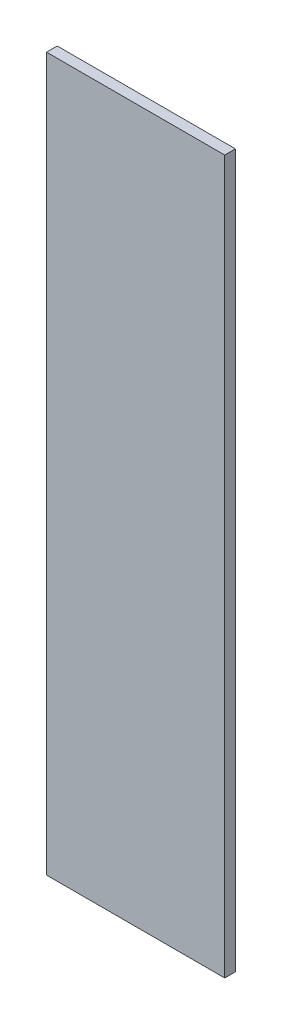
from build123d import *

# Parameters (mm, degrees)
SKETCH1_W           = 50
SKETCH1_H           = 200
BOSS_EXTRUDE1_DEPTH = 3


with BuildPart() as part:
    # Sketch1 → Boss-Extrude1 (new body)
    with BuildSketch(Plane.XY):
        Rectangle(SKETCH1_W, SKETCH1_H)
    extrude(amount=BOSS_EXTRUDE1_DEPTH)


solid = part.part
